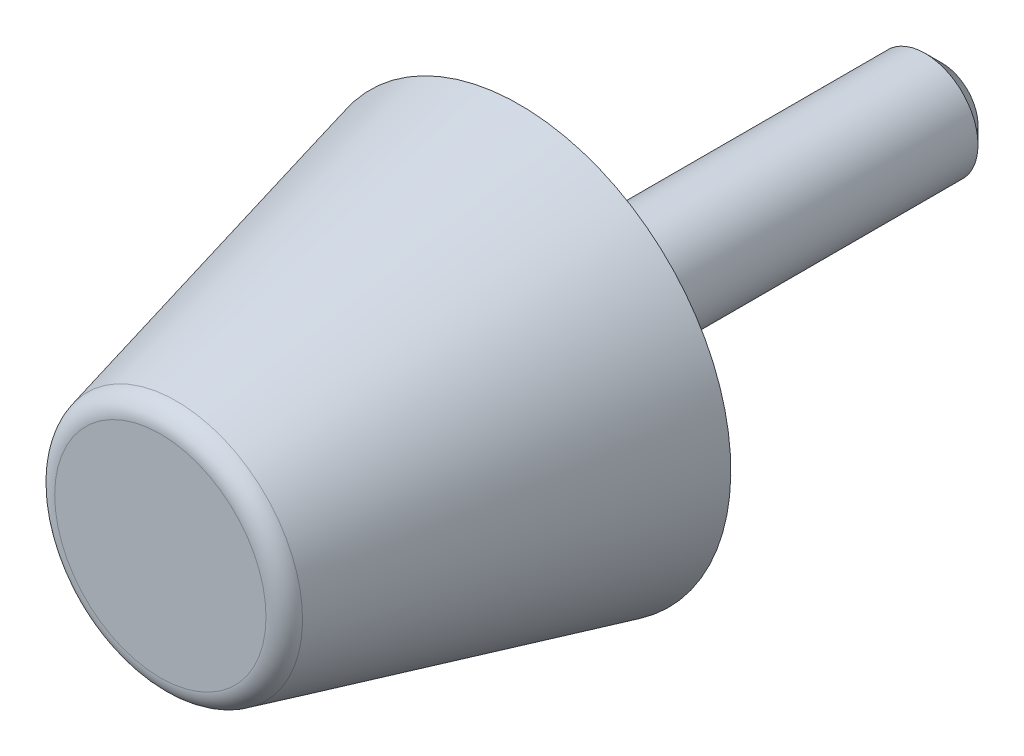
ISO-10303-21;
HEADER;
FILE_DESCRIPTION(('STEP AP214'),'2;1');
FILE_NAME('part.step','',(''),(''),'','','');
FILE_SCHEMA(('AUTOMOTIVE_DESIGN { 1 0 10303 214 1 1 1 1 }'));
ENDSEC;
DATA;
#1=APPLICATION_CONTEXT('core data for automotive mechanical design processes');
#2=APPLICATION_PROTOCOL_DEFINITION('international standard','automotive_design',2000,#1);
#3=PRODUCT_CONTEXT('',#1,'mechanical');
#4=PRODUCT('Part','Part','',(#3));
#5=PRODUCT_RELATED_PRODUCT_CATEGORY('part','',(#4));
#6=PRODUCT_DEFINITION_FORMATION('','',#4);
#7=PRODUCT_DEFINITION_CONTEXT('part definition',#1,'design');
#8=PRODUCT_DEFINITION('design','',#6,#7);
#9=PRODUCT_DEFINITION_SHAPE('','',#8);
#10=(LENGTH_UNIT() NAMED_UNIT(*) SI_UNIT(.MILLI.,.METRE.));
#11=(NAMED_UNIT(*) PLANE_ANGLE_UNIT() SI_UNIT($,.RADIAN.));
#12=(NAMED_UNIT(*) SI_UNIT($,.STERADIAN.) SOLID_ANGLE_UNIT());
#13=UNCERTAINTY_MEASURE_WITH_UNIT(LENGTH_MEASURE(1.E-05),#10,'distance_accuracy_value','');
#14=(GEOMETRIC_REPRESENTATION_CONTEXT(3) GLOBAL_UNCERTAINTY_ASSIGNED_CONTEXT((#13)) GLOBAL_UNIT_ASSIGNED_CONTEXT((#10,
#11,#12)) REPRESENTATION_CONTEXT('',''));
#15=CARTESIAN_POINT('',(0.,0.,0.));
#16=DIRECTION('',(0.,0.,1.));
#17=DIRECTION('',(1.,0.,0.));
#18=AXIS2_PLACEMENT_3D('',#15,#16,#17);
#19=CARTESIAN_POINT('',(0.,0.,17.));
#20=DIRECTION('',(0.,0.,1.));
#21=DIRECTION('',(0.,-1.,0.));
#22=AXIS2_PLACEMENT_3D('',#19,#20,#21);
#23=CYLINDRICAL_SURFACE('',#22,9.);
#24=CARTESIAN_POINT('',(0.,0.,0.));
#25=DIRECTION('',(0.,0.,1.));
#26=DIRECTION('',(0.,-1.,0.));
#27=AXIS2_PLACEMENT_3D('',#24,#25,#26);
#28=CIRCLE('',#27,9.);
#29=CARTESIAN_POINT('',(0.,-9.,0.));
#30=VERTEX_POINT('',#29);
#31=EDGE_CURVE('E27',#30,#30,#28,.T.);
#32=ORIENTED_EDGE('',*,*,#31,.F.);
#33=EDGE_LOOP('',(#32));
#34=FACE_BOUND('',#33,.T.);
#35=CARTESIAN_POINT('',(0.,0.,0.0500000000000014));
#36=DIRECTION('',(0.,0.,1.));
#37=DIRECTION('',(0.,-1.,0.));
#38=AXIS2_PLACEMENT_3D('',#35,#36,#37);
#39=CIRCLE('',#38,9.);
#40=CARTESIAN_POINT('',(0.,-9.,0.0500000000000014));
#41=VERTEX_POINT('',#40);
#42=EDGE_CURVE('E44',#41,#41,#39,.T.);
#43=ORIENTED_EDGE('',*,*,#42,.T.);
#44=EDGE_LOOP('',(#43));
#45=FACE_BOUND('',#44,.T.);
#46=ADVANCED_FACE('F12',(#34,#45),#23,.F.);
#47=CARTESIAN_POINT('',(9.,0.,0.));
#48=DIRECTION('',(0.,0.,1.));
#49=DIRECTION('',(0.,-1.,0.));
#50=AXIS2_PLACEMENT_3D('',#47,#48,#49);
#51=PLANE('',#50);
#52=CARTESIAN_POINT('',(0.,0.,0.));
#53=DIRECTION('',(0.,0.,1.));
#54=DIRECTION('',(0.,-1.,0.));
#55=AXIS2_PLACEMENT_3D('',#52,#53,#54);
#56=CIRCLE('',#55,10.);
#57=CARTESIAN_POINT('',(0.,-10.,0.));
#58=VERTEX_POINT('',#57);
#59=EDGE_CURVE('E32',#58,#58,#56,.T.);
#60=ORIENTED_EDGE('',*,*,#59,.F.);
#61=EDGE_LOOP('',(#60));
#62=FACE_BOUND('',#61,.T.);
#63=ORIENTED_EDGE('',*,*,#31,.T.);
#64=EDGE_LOOP('',(#63));
#65=FACE_BOUND('',#64,.T.);
#66=ADVANCED_FACE('F72',(#62,#65),#51,.F.);
#67=CARTESIAN_POINT('',(0.,0.,0.));
#68=DIRECTION('',(0.,0.,-1.));
#69=DIRECTION('',(0.,1.,0.));
#70=AXIS2_PLACEMENT_3D('',#67,#68,#69);
#71=CONICAL_SURFACE('',#70,10.,0.243194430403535);
#72=CARTESIAN_POINT('',(0.,0.,16.2408042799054));
#73=DIRECTION('',(0.,0.,1.));
#74=DIRECTION('',(0.,-1.,0.));
#75=AXIS2_PLACEMENT_3D('',#72,#73,#74);
#76=CIRCLE('',#75,5.97057369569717);
#77=CARTESIAN_POINT('',(0.,-5.97057369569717,16.2408042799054));
#78=VERTEX_POINT('',#77);
#79=EDGE_CURVE('E35',#78,#78,#76,.T.);
#80=ORIENTED_EDGE('',*,*,#79,.F.);
#81=EDGE_LOOP('',(#80));
#82=FACE_BOUND('',#81,.T.);
#83=ORIENTED_EDGE('',*,*,#59,.T.);
#84=EDGE_LOOP('',(#83));
#85=FACE_BOUND('',#84,.T.);
#86=ADVANCED_FACE('F77',(#82,#85),#71,.T.);
#87=CARTESIAN_POINT('',(0.,0.,16.));
#88=DIRECTION('',(0.,0.,1.));
#89=DIRECTION('',(0.,-1.,0.));
#90=AXIS2_PLACEMENT_3D('',#87,#88,#89);
#91=TOROIDAL_SURFACE('',#90,5.,1.);
#92=ORIENTED_EDGE('',*,*,#79,.T.);
#93=EDGE_LOOP('',(#92));
#94=FACE_BOUND('',#93,.T.);
#95=CARTESIAN_POINT('',(0.,0.,17.));
#96=DIRECTION('',(0.,0.,1.));
#97=DIRECTION('',(0.,-1.,0.));
#98=AXIS2_PLACEMENT_3D('',#95,#96,#97);
#99=CIRCLE('',#98,5.);
#100=CARTESIAN_POINT('',(0.,-5.,17.));
#101=VERTEX_POINT('',#100);
#102=EDGE_CURVE('E38',#101,#101,#99,.T.);
#103=ORIENTED_EDGE('',*,*,#102,.F.);
#104=EDGE_LOOP('',(#103));
#105=FACE_BOUND('',#104,.T.);
#106=ADVANCED_FACE('F84',(#94,#105),#91,.T.);
#107=CARTESIAN_POINT('',(5.,0.,17.));
#108=DIRECTION('',(0.,0.,-1.));
#109=DIRECTION('',(0.,1.,0.));
#110=AXIS2_PLACEMENT_3D('',#107,#108,#109);
#111=PLANE('',#110);
#112=ORIENTED_EDGE('',*,*,#102,.T.);
#113=EDGE_LOOP('',(#112));
#114=FACE_BOUND('',#113,.T.);
#115=ADVANCED_FACE('F59',(#114),#111,.F.);
#116=CARTESIAN_POINT('',(0.,0.,0.));
#117=DIRECTION('',(0.,0.,1.));
#118=DIRECTION('',(0.,-1.,0.));
#119=AXIS2_PLACEMENT_3D('',#116,#117,#118);
#120=PLANE('',#119);
#121=CARTESIAN_POINT('',(0.,0.,0.));
#122=DIRECTION('',(0.,0.,1.));
#123=DIRECTION('',(0.,-1.,0.));
#124=AXIS2_PLACEMENT_3D('',#121,#122,#123);
#125=CIRCLE('',#124,8.95);
#126=CARTESIAN_POINT('',(0.,-8.95,0.));
#127=VERTEX_POINT('',#126);
#128=EDGE_CURVE('E41',#127,#127,#125,.T.);
#129=ORIENTED_EDGE('',*,*,#128,.F.);
#130=EDGE_LOOP('',(#129));
#131=FACE_BOUND('',#130,.T.);
#132=CARTESIAN_POINT('',(0.,0.,0.));
#133=DIRECTION('',(0.,0.,1.));
#134=DIRECTION('',(0.,-1.,0.));
#135=AXIS2_PLACEMENT_3D('',#132,#133,#134);
#136=CIRCLE('',#135,2.5);
#137=CARTESIAN_POINT('',(0.,-2.5,0.));
#138=VERTEX_POINT('',#137);
#139=EDGE_CURVE('E23',#138,#138,#136,.T.);
#140=ORIENTED_EDGE('',*,*,#139,.T.);
#141=EDGE_LOOP('',(#140));
#142=FACE_BOUND('',#141,.T.);
#143=ADVANCED_FACE('F53',(#131,#142),#120,.F.);
#144=CARTESIAN_POINT('',(0.,0.,0.));
#145=DIRECTION('',(0.,0.,1.));
#146=DIRECTION('',(0.,-1.,0.));
#147=AXIS2_PLACEMENT_3D('',#144,#145,#146);
#148=CONICAL_SURFACE('',#147,8.95,0.785398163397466);
#149=ORIENTED_EDGE('',*,*,#42,.F.);
#150=EDGE_LOOP('',(#149));
#151=FACE_BOUND('',#150,.T.);
#152=ORIENTED_EDGE('',*,*,#128,.T.);
#153=EDGE_LOOP('',(#152));
#154=FACE_BOUND('',#153,.T.);
#155=ADVANCED_FACE('F49',(#151,#154),#148,.T.);
#156=CARTESIAN_POINT('',(0.,0.,17.));
#157=DIRECTION('',(0.,0.,1.));
#158=DIRECTION('',(0.,-1.,0.));
#159=AXIS2_PLACEMENT_3D('',#156,#157,#158);
#160=CYLINDRICAL_SURFACE('',#159,2.5);
#161=CARTESIAN_POINT('',(0.,0.,-19.2));
#162=DIRECTION('',(0.,0.,-1.));
#163=DIRECTION('',(0.,1.,0.));
#164=AXIS2_PLACEMENT_3D('',#161,#162,#163);
#165=CIRCLE('',#164,2.5);
#166=CARTESIAN_POINT('',(0.,2.5,-19.2));
#167=VERTEX_POINT('',#166);
#168=EDGE_CURVE('E8',#167,#167,#165,.F.);
#169=ORIENTED_EDGE('',*,*,#168,.T.);
#170=EDGE_LOOP('',(#169));
#171=FACE_BOUND('',#170,.T.);
#172=ORIENTED_EDGE('',*,*,#139,.F.);
#173=EDGE_LOOP('',(#172));
#174=FACE_BOUND('',#173,.T.);
#175=ADVANCED_FACE('F52',(#171,#174),#160,.T.);
#176=CARTESIAN_POINT('',(0.,0.,-20.));
#177=DIRECTION('',(0.,0.,-1.));
#178=DIRECTION('',(0.,1.,0.));
#179=AXIS2_PLACEMENT_3D('',#176,#177,#178);
#180=PLANE('',#179);
#181=CARTESIAN_POINT('',(0.,0.,-20.));
#182=DIRECTION('',(0.,0.,-1.));
#183=DIRECTION('',(0.,1.,0.));
#184=AXIS2_PLACEMENT_3D('',#181,#182,#183);
#185=CIRCLE('',#184,1.7);
#186=CARTESIAN_POINT('',(0.,1.7,-20.));
#187=VERTEX_POINT('',#186);
#188=EDGE_CURVE('E19',#187,#187,#185,.T.);
#189=ORIENTED_EDGE('',*,*,#188,.T.);
#190=EDGE_LOOP('',(#189));
#191=FACE_BOUND('',#190,.T.);
#192=ADVANCED_FACE('F64',(#191),#180,.T.);
#193=CARTESIAN_POINT('',(0.,0.,-20.));
#194=DIRECTION('',(0.,0.,1.));
#195=DIRECTION('',(0.,-1.,0.));
#196=AXIS2_PLACEMENT_3D('',#193,#194,#195);
#197=CONICAL_SURFACE('',#196,1.7,0.785398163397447);
#198=ORIENTED_EDGE('',*,*,#168,.F.);
#199=EDGE_LOOP('',(#198));
#200=FACE_BOUND('',#199,.T.);
#201=ORIENTED_EDGE('',*,*,#188,.F.);
#202=EDGE_LOOP('',(#201));
#203=FACE_BOUND('',#202,.T.);
#204=ADVANCED_FACE('F14',(#200,#203),#197,.T.);
#205=CLOSED_SHELL('',(#46,#66,#86,#106,#115,#143,#155,#175,#192,#204));
#206=MANIFOLD_SOLID_BREP('B1',#205);
#207=ADVANCED_BREP_SHAPE_REPRESENTATION('',(#18,#206),#14);
#208=SHAPE_DEFINITION_REPRESENTATION(#9,#207);
ENDSEC;
END-ISO-10303-21;
